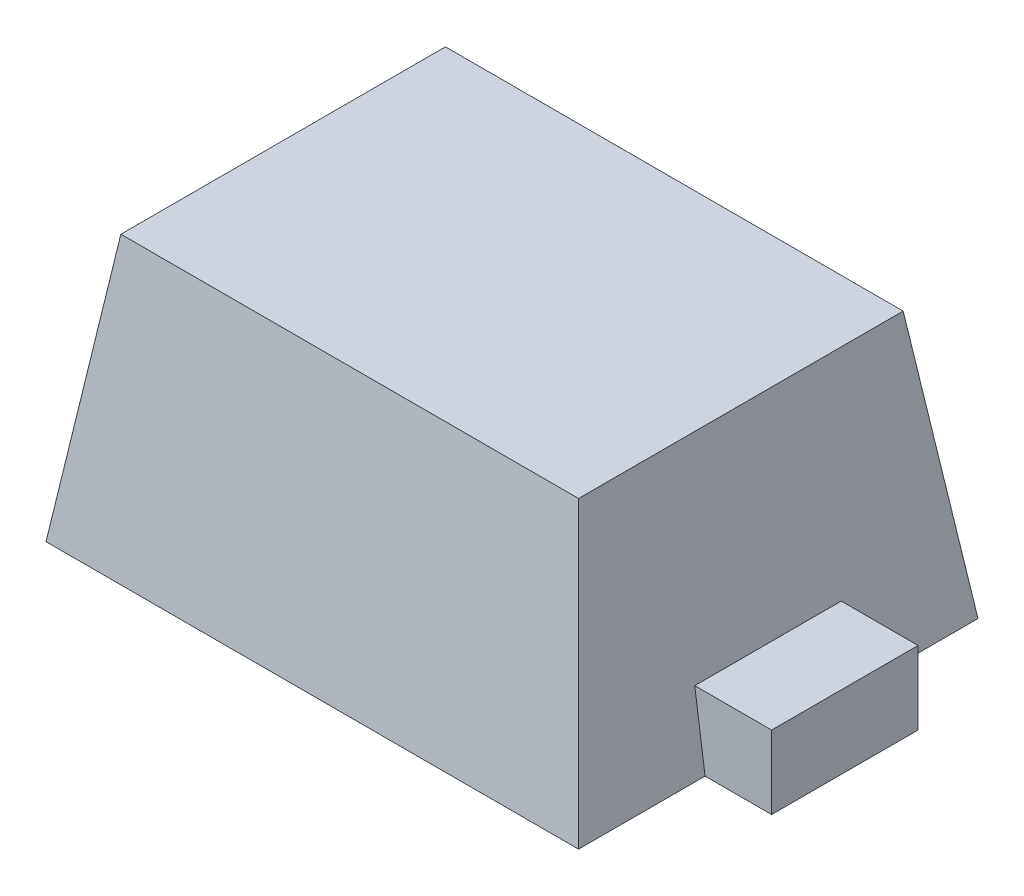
ISO-10303-21;
HEADER;
FILE_DESCRIPTION(('STEP AP214'),'2;1');
FILE_NAME('part.step','',(''),(''),'','','');
FILE_SCHEMA(('AUTOMOTIVE_DESIGN { 1 0 10303 214 1 1 1 1 }'));
ENDSEC;
DATA;
#1=APPLICATION_CONTEXT('core data for automotive mechanical design processes');
#2=APPLICATION_PROTOCOL_DEFINITION('international standard','automotive_design',2000,#1);
#3=PRODUCT_CONTEXT('',#1,'mechanical');
#4=PRODUCT('Part','Part','',(#3));
#5=PRODUCT_RELATED_PRODUCT_CATEGORY('part','',(#4));
#6=PRODUCT_DEFINITION_FORMATION('','',#4);
#7=PRODUCT_DEFINITION_CONTEXT('part definition',#1,'design');
#8=PRODUCT_DEFINITION('design','',#6,#7);
#9=PRODUCT_DEFINITION_SHAPE('','',#8);
#10=(LENGTH_UNIT() NAMED_UNIT(*) SI_UNIT(.MILLI.,.METRE.));
#11=(NAMED_UNIT(*) PLANE_ANGLE_UNIT() SI_UNIT($,.RADIAN.));
#12=(NAMED_UNIT(*) SI_UNIT($,.STERADIAN.) SOLID_ANGLE_UNIT());
#13=UNCERTAINTY_MEASURE_WITH_UNIT(LENGTH_MEASURE(1.E-05),#10,'distance_accuracy_value','');
#14=(GEOMETRIC_REPRESENTATION_CONTEXT(3) GLOBAL_UNCERTAINTY_ASSIGNED_CONTEXT((#13)) GLOBAL_UNIT_ASSIGNED_CONTEXT((#10,
#11,#12)) REPRESENTATION_CONTEXT('',''));
#15=CARTESIAN_POINT('',(0.,0.,0.));
#16=DIRECTION('',(0.,0.,1.));
#17=DIRECTION('',(1.,0.,0.));
#18=AXIS2_PLACEMENT_3D('',#15,#16,#17);
#19=CARTESIAN_POINT('',(-0.4,0.,0.3));
#20=DIRECTION('',(0.,1.,0.));
#21=DIRECTION('',(1.,0.,0.));
#22=AXIS2_PLACEMENT_3D('',#19,#20,#21);
#23=PLANE('',#22);
#24=DIRECTION('',(0.,0.,1.));
#25=VECTOR('',#24,1.);
#26=CARTESIAN_POINT('',(-0.4,0.,-0.3));
#27=LINE('',#26,#25);
#28=CARTESIAN_POINT('',(-0.4,0.,-0.3));
#29=VERTEX_POINT('',#28);
#30=CARTESIAN_POINT('',(-0.4,0.,0.3));
#31=VERTEX_POINT('',#30);
#32=EDGE_CURVE('P0_E81',#29,#31,#27,.T.);
#33=ORIENTED_EDGE('',*,*,#32,.F.);
#34=DIRECTION('',(-1.,0.,0.));
#35=VECTOR('',#34,1.);
#36=CARTESIAN_POINT('',(-0.4,0.,-0.3));
#37=LINE('',#36,#35);
#38=CARTESIAN_POINT('',(0.4,0.,-0.3));
#39=VERTEX_POINT('',#38);
#40=EDGE_CURVE('P0_E98',#39,#29,#37,.T.);
#41=ORIENTED_EDGE('',*,*,#40,.F.);
#42=DIRECTION('',(0.,0.,-1.));
#43=VECTOR('',#42,1.);
#44=CARTESIAN_POINT('',(0.4,0.,-0.3));
#45=LINE('',#44,#43);
#46=CARTESIAN_POINT('',(0.4,0.,0.3));
#47=VERTEX_POINT('',#46);
#48=EDGE_CURVE('P0_E112',#47,#39,#45,.T.);
#49=ORIENTED_EDGE('',*,*,#48,.F.);
#50=DIRECTION('',(1.,0.,0.));
#51=VECTOR('',#50,1.);
#52=CARTESIAN_POINT('',(-0.4,0.,0.3));
#53=LINE('',#52,#51);
#54=EDGE_CURVE('P0_E11',#31,#47,#53,.T.);
#55=ORIENTED_EDGE('',*,*,#54,.F.);
#56=EDGE_LOOP('',(#33,#41,#49,#55));
#57=FACE_BOUND('',#56,.T.);
#58=ADVANCED_FACE('P0_F17',(#57),#23,.F.);
#59=CARTESIAN_POINT('',(-0.4,0.,0.3));
#60=DIRECTION('',(0.,0.139173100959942,0.990268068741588));
#61=DIRECTION('',(1.,0.,0.));
#62=AXIS2_PLACEMENT_3D('',#59,#60,#61);
#63=PLANE('',#62);
#64=ORIENTED_EDGE('',*,*,#54,.T.);
#65=DIRECTION('',(0.137844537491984,-0.980814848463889,0.137844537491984));
#66=VECTOR('',#65,1.);
#67=CARTESIAN_POINT('',(0.38859933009,0.08111998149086,0.28859933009));
#68=LINE('',#67,#66);
#69=CARTESIAN_POINT('',(0.343783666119,0.4,0.243783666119));
#70=VERTEX_POINT('',#69);
#71=EDGE_CURVE('P0_E25',#70,#47,#68,.T.);
#72=ORIENTED_EDGE('',*,*,#71,.F.);
#73=DIRECTION('',(1.,0.,0.));
#74=VECTOR('',#73,1.);
#75=CARTESIAN_POINT('',(-0.4,0.4,0.243783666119));
#76=LINE('',#75,#74);
#77=CARTESIAN_POINT('',(-0.343783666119,0.4,0.243783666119));
#78=VERTEX_POINT('',#77);
#79=EDGE_CURVE('P0_E38',#78,#70,#76,.T.);
#80=ORIENTED_EDGE('',*,*,#79,.F.);
#81=DIRECTION('',(-0.137844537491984,-0.980814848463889,0.137844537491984));
#82=VECTOR('',#81,1.);
#83=CARTESIAN_POINT('',(-0.4,0.,0.3));
#84=LINE('',#83,#82);
#85=EDGE_CURVE('P0_E75',#78,#31,#84,.T.);
#86=ORIENTED_EDGE('',*,*,#85,.T.);
#87=EDGE_LOOP('',(#64,#72,#80,#86));
#88=FACE_BOUND('',#87,.T.);
#89=ADVANCED_FACE('P0_F89',(#88),#63,.T.);
#90=CARTESIAN_POINT('',(0.4,0.,-0.3));
#91=DIRECTION('',(0.990268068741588,0.139173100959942,0.));
#92=DIRECTION('',(0.,0.,-1.));
#93=AXIS2_PLACEMENT_3D('',#90,#91,#92);
#94=PLANE('',#93);
#95=ORIENTED_EDGE('',*,*,#48,.T.);
#96=DIRECTION('',(0.137844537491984,-0.980814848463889,-0.137844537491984));
#97=VECTOR('',#96,1.);
#98=CARTESIAN_POINT('',(0.384799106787,0.108159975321,-0.284799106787));
#99=LINE('',#98,#97);
#100=CARTESIAN_POINT('',(0.343783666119,0.4,-0.243783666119));
#101=VERTEX_POINT('',#100);
#102=EDGE_CURVE('P0_E100',#101,#39,#99,.T.);
#103=ORIENTED_EDGE('',*,*,#102,.F.);
#104=DIRECTION('',(0.,0.,-1.));
#105=VECTOR('',#104,1.);
#106=CARTESIAN_POINT('',(0.343783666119,0.4,-0.3));
#107=LINE('',#106,#105);
#108=EDGE_CURVE('P0_E108',#70,#101,#107,.T.);
#109=ORIENTED_EDGE('',*,*,#108,.F.);
#110=ORIENTED_EDGE('',*,*,#71,.T.);
#111=EDGE_LOOP('',(#95,#103,#109,#110));
#112=FACE_BOUND('',#111,.T.);
#113=ADVANCED_FACE('P0_F120',(#112),#94,.T.);
#114=CARTESIAN_POINT('',(-0.4,0.,-0.3));
#115=DIRECTION('',(0.,0.139173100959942,-0.990268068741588));
#116=DIRECTION('',(-1.,0.,0.));
#117=AXIS2_PLACEMENT_3D('',#114,#115,#116);
#118=PLANE('',#117);
#119=ORIENTED_EDGE('',*,*,#40,.T.);
#120=DIRECTION('',(-0.137844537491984,-0.980814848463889,-0.137844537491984));
#121=VECTOR('',#120,1.);
#122=CARTESIAN_POINT('',(-0.4,0.,-0.3));
#123=LINE('',#122,#121);
#124=CARTESIAN_POINT('',(-0.343783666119,0.4,-0.243783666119));
#125=VERTEX_POINT('',#124);
#126=EDGE_CURVE('P0_E83',#125,#29,#123,.T.);
#127=ORIENTED_EDGE('',*,*,#126,.F.);
#128=DIRECTION('',(-1.,0.,0.));
#129=VECTOR('',#128,1.);
#130=CARTESIAN_POINT('',(-0.4,0.4,-0.243783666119));
#131=LINE('',#130,#129);
#132=EDGE_CURVE('P0_E86',#101,#125,#131,.T.);
#133=ORIENTED_EDGE('',*,*,#132,.F.);
#134=ORIENTED_EDGE('',*,*,#102,.T.);
#135=EDGE_LOOP('',(#119,#127,#133,#134));
#136=FACE_BOUND('',#135,.T.);
#137=ADVANCED_FACE('P0_F124',(#136),#118,.T.);
#138=CARTESIAN_POINT('',(-0.4,0.,-0.3));
#139=DIRECTION('',(-0.990268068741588,0.139173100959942,0.));
#140=DIRECTION('',(0.,0.,1.));
#141=AXIS2_PLACEMENT_3D('',#138,#139,#140);
#142=PLANE('',#141);
#143=ORIENTED_EDGE('',*,*,#32,.T.);
#144=ORIENTED_EDGE('',*,*,#85,.F.);
#145=DIRECTION('',(0.,0.,1.));
#146=VECTOR('',#145,1.);
#147=CARTESIAN_POINT('',(-0.343783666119,0.4,-0.3));
#148=LINE('',#147,#146);
#149=EDGE_CURVE('P0_E78',#125,#78,#148,.T.);
#150=ORIENTED_EDGE('',*,*,#149,.F.);
#151=ORIENTED_EDGE('',*,*,#126,.T.);
#152=EDGE_LOOP('',(#143,#144,#150,#151));
#153=FACE_BOUND('',#152,.T.);
#154=ADVANCED_FACE('P0_F76',(#153),#142,.T.);
#155=CARTESIAN_POINT('',(-0.4,0.4,0.3));
#156=DIRECTION('',(0.,1.,0.));
#157=DIRECTION('',(1.,0.,0.));
#158=AXIS2_PLACEMENT_3D('',#155,#156,#157);
#159=PLANE('',#158);
#160=ORIENTED_EDGE('',*,*,#79,.T.);
#161=ORIENTED_EDGE('',*,*,#108,.T.);
#162=ORIENTED_EDGE('',*,*,#132,.T.);
#163=ORIENTED_EDGE('',*,*,#149,.T.);
#164=EDGE_LOOP('',(#160,#161,#162,#163));
#165=FACE_BOUND('',#164,.T.);
#166=ADVANCED_FACE('P0_F85',(#165),#159,.T.);
#167=CLOSED_SHELL('',(#58,#89,#113,#137,#154,#166));
#168=MANIFOLD_SOLID_BREP('P0_B1',#167);
#169=CARTESIAN_POINT('',(0.32,0.,0.11));
#170=DIRECTION('',(0.,1.,0.));
#171=DIRECTION('',(1.,0.,0.));
#172=AXIS2_PLACEMENT_3D('',#169,#170,#171);
#173=PLANE('',#172);
#174=DIRECTION('',(0.,0.,1.));
#175=VECTOR('',#174,1.);
#176=CARTESIAN_POINT('',(0.32,0.,-0.11));
#177=LINE('',#176,#175);
#178=CARTESIAN_POINT('',(0.32,0.,-0.11));
#179=VERTEX_POINT('',#178);
#180=CARTESIAN_POINT('',(0.32,0.,0.11));
#181=VERTEX_POINT('',#180);
#182=EDGE_CURVE('P1_E90',#179,#181,#177,.T.);
#183=ORIENTED_EDGE('',*,*,#182,.F.);
#184=DIRECTION('',(-1.,0.,0.));
#185=VECTOR('',#184,1.);
#186=CARTESIAN_POINT('',(0.32,0.,-0.11));
#187=LINE('',#186,#185);
#188=CARTESIAN_POINT('',(0.5,0.,-0.11));
#189=VERTEX_POINT('',#188);
#190=EDGE_CURVE('P1_E83',#189,#179,#187,.T.);
#191=ORIENTED_EDGE('',*,*,#190,.F.);
#192=DIRECTION('',(0.,0.,-1.));
#193=VECTOR('',#192,1.);
#194=CARTESIAN_POINT('',(0.5,0.,-0.11));
#195=LINE('',#194,#193);
#196=CARTESIAN_POINT('',(0.5,0.,0.11));
#197=VERTEX_POINT('',#196);
#198=EDGE_CURVE('P1_E70',#197,#189,#195,.T.);
#199=ORIENTED_EDGE('',*,*,#198,.F.);
#200=DIRECTION('',(1.,0.,0.));
#201=VECTOR('',#200,1.);
#202=CARTESIAN_POINT('',(0.32,0.,0.11));
#203=LINE('',#202,#201);
#204=EDGE_CURVE('P1_E26',#181,#197,#203,.T.);
#205=ORIENTED_EDGE('',*,*,#204,.F.);
#206=EDGE_LOOP('',(#183,#191,#199,#205));
#207=FACE_BOUND('',#206,.T.);
#208=ADVANCED_FACE('P1_F17',(#207),#173,.F.);
#209=CARTESIAN_POINT('',(0.32,0.11,0.11));
#210=DIRECTION('',(0.,1.,0.));
#211=DIRECTION('',(1.,0.,0.));
#212=AXIS2_PLACEMENT_3D('',#209,#210,#211);
#213=PLANE('',#212);
#214=DIRECTION('',(0.,0.,1.));
#215=VECTOR('',#214,1.);
#216=CARTESIAN_POINT('',(0.32,0.11,-0.11));
#217=LINE('',#216,#215);
#218=CARTESIAN_POINT('',(0.32,0.11,-0.11));
#219=VERTEX_POINT('',#218);
#220=CARTESIAN_POINT('',(0.32,0.11,0.11));
#221=VERTEX_POINT('',#220);
#222=EDGE_CURVE('P1_E100',#219,#221,#217,.T.);
#223=ORIENTED_EDGE('',*,*,#222,.T.);
#224=DIRECTION('',(1.,0.,0.));
#225=VECTOR('',#224,1.);
#226=CARTESIAN_POINT('',(0.32,0.11,0.11));
#227=LINE('',#226,#225);
#228=CARTESIAN_POINT('',(0.5,0.11,0.11));
#229=VERTEX_POINT('',#228);
#230=EDGE_CURVE('P1_E11',#221,#229,#227,.T.);
#231=ORIENTED_EDGE('',*,*,#230,.T.);
#232=DIRECTION('',(0.,0.,-1.));
#233=VECTOR('',#232,1.);
#234=CARTESIAN_POINT('',(0.5,0.11,-0.11));
#235=LINE('',#234,#233);
#236=CARTESIAN_POINT('',(0.5,0.11,-0.11));
#237=VERTEX_POINT('',#236);
#238=EDGE_CURVE('P1_E60',#229,#237,#235,.T.);
#239=ORIENTED_EDGE('',*,*,#238,.T.);
#240=DIRECTION('',(-1.,0.,0.));
#241=VECTOR('',#240,1.);
#242=CARTESIAN_POINT('',(0.32,0.11,-0.11));
#243=LINE('',#242,#241);
#244=EDGE_CURVE('P1_E85',#237,#219,#243,.T.);
#245=ORIENTED_EDGE('',*,*,#244,.T.);
#246=EDGE_LOOP('',(#223,#231,#239,#245));
#247=FACE_BOUND('',#246,.T.);
#248=ADVANCED_FACE('P1_F215',(#247),#213,.T.);
#249=CARTESIAN_POINT('',(0.32,0.11,0.11));
#250=DIRECTION('',(0.,0.,-1.));
#251=DIRECTION('',(0.,-1.,0.));
#252=AXIS2_PLACEMENT_3D('',#249,#250,#251);
#253=PLANE('',#252);
#254=ORIENTED_EDGE('',*,*,#204,.T.);
#255=DIRECTION('',(0.,-1.,0.));
#256=VECTOR('',#255,1.);
#257=CARTESIAN_POINT('',(0.5,0.11,0.11));
#258=LINE('',#257,#256);
#259=EDGE_CURVE('P1_E75',#229,#197,#258,.T.);
#260=ORIENTED_EDGE('',*,*,#259,.F.);
#261=ORIENTED_EDGE('',*,*,#230,.F.);
#262=DIRECTION('',(0.,-1.,0.));
#263=VECTOR('',#262,1.);
#264=CARTESIAN_POINT('',(0.32,0.11,0.11));
#265=LINE('',#264,#263);
#266=EDGE_CURVE('P1_E105',#221,#181,#265,.T.);
#267=ORIENTED_EDGE('',*,*,#266,.T.);
#268=EDGE_LOOP('',(#254,#260,#261,#267));
#269=FACE_BOUND('',#268,.T.);
#270=ADVANCED_FACE('P1_F119',(#269),#253,.F.);
#271=CARTESIAN_POINT('',(0.5,0.11,-0.11));
#272=DIRECTION('',(-1.,0.,0.));
#273=DIRECTION('',(0.,0.,1.));
#274=AXIS2_PLACEMENT_3D('',#271,#272,#273);
#275=PLANE('',#274);
#276=ORIENTED_EDGE('',*,*,#198,.T.);
#277=DIRECTION('',(0.,-1.,0.));
#278=VECTOR('',#277,1.);
#279=CARTESIAN_POINT('',(0.5,0.11,-0.11));
#280=LINE('',#279,#278);
#281=EDGE_CURVE('P1_E73',#237,#189,#280,.T.);
#282=ORIENTED_EDGE('',*,*,#281,.F.);
#283=ORIENTED_EDGE('',*,*,#238,.F.);
#284=ORIENTED_EDGE('',*,*,#259,.T.);
#285=EDGE_LOOP('',(#276,#282,#283,#284));
#286=FACE_BOUND('',#285,.T.);
#287=ADVANCED_FACE('P1_F72',(#286),#275,.F.);
#288=CARTESIAN_POINT('',(0.32,0.11,-0.11));
#289=DIRECTION('',(0.,0.,1.));
#290=DIRECTION('',(1.,0.,0.));
#291=AXIS2_PLACEMENT_3D('',#288,#289,#290);
#292=PLANE('',#291);
#293=ORIENTED_EDGE('',*,*,#190,.T.);
#294=DIRECTION('',(0.,-1.,0.));
#295=VECTOR('',#294,1.);
#296=CARTESIAN_POINT('',(0.32,0.11,-0.11));
#297=LINE('',#296,#295);
#298=EDGE_CURVE('P1_E92',#219,#179,#297,.T.);
#299=ORIENTED_EDGE('',*,*,#298,.F.);
#300=ORIENTED_EDGE('',*,*,#244,.F.);
#301=ORIENTED_EDGE('',*,*,#281,.T.);
#302=EDGE_LOOP('',(#293,#299,#300,#301));
#303=FACE_BOUND('',#302,.T.);
#304=ADVANCED_FACE('P1_F81',(#303),#292,.F.);
#305=CARTESIAN_POINT('',(0.32,0.11,-0.11));
#306=DIRECTION('',(1.,0.,0.));
#307=DIRECTION('',(0.,1.,0.));
#308=AXIS2_PLACEMENT_3D('',#305,#306,#307);
#309=PLANE('',#308);
#310=ORIENTED_EDGE('',*,*,#182,.T.);
#311=ORIENTED_EDGE('',*,*,#266,.F.);
#312=ORIENTED_EDGE('',*,*,#222,.F.);
#313=ORIENTED_EDGE('',*,*,#298,.T.);
#314=EDGE_LOOP('',(#310,#311,#312,#313));
#315=FACE_BOUND('',#314,.T.);
#316=ADVANCED_FACE('P1_F123',(#315),#309,.F.);
#317=CLOSED_SHELL('',(#208,#248,#270,#287,#304,#316));
#318=MANIFOLD_SOLID_BREP('P1_B1',#317);
#319=CARTESIAN_POINT('',(-0.5,0.,-0.11));
#320=DIRECTION('',(0.,1.,0.));
#321=DIRECTION('',(1.,0.,0.));
#322=AXIS2_PLACEMENT_3D('',#319,#320,#321);
#323=PLANE('',#322);
#324=DIRECTION('',(-1.,0.,0.));
#325=VECTOR('',#324,1.);
#326=CARTESIAN_POINT('',(-0.32,0.,-0.11));
#327=LINE('',#326,#325);
#328=CARTESIAN_POINT('',(-0.32,0.,-0.11));
#329=VERTEX_POINT('',#328);
#330=CARTESIAN_POINT('',(-0.5,0.,-0.11));
#331=VERTEX_POINT('',#330);
#332=EDGE_CURVE('P2_E91',#329,#331,#327,.T.);
#333=ORIENTED_EDGE('',*,*,#332,.F.);
#334=DIRECTION('',(0.,0.,-1.));
#335=VECTOR('',#334,1.);
#336=CARTESIAN_POINT('',(-0.32,0.,-0.11));
#337=LINE('',#336,#335);
#338=CARTESIAN_POINT('',(-0.32,0.,0.11));
#339=VERTEX_POINT('',#338);
#340=EDGE_CURVE('P2_E73',#339,#329,#337,.T.);
#341=ORIENTED_EDGE('',*,*,#340,.F.);
#342=DIRECTION('',(1.,0.,0.));
#343=VECTOR('',#342,1.);
#344=CARTESIAN_POINT('',(-0.32,0.,0.11));
#345=LINE('',#344,#343);
#346=CARTESIAN_POINT('',(-0.5,0.,0.11));
#347=VERTEX_POINT('',#346);
#348=EDGE_CURVE('P2_E105',#347,#339,#345,.T.);
#349=ORIENTED_EDGE('',*,*,#348,.F.);
#350=DIRECTION('',(0.,0.,1.));
#351=VECTOR('',#350,1.);
#352=CARTESIAN_POINT('',(-0.5,0.,-0.11));
#353=LINE('',#352,#351);
#354=EDGE_CURVE('P2_E25',#331,#347,#353,.T.);
#355=ORIENTED_EDGE('',*,*,#354,.F.);
#356=EDGE_LOOP('',(#333,#341,#349,#355));
#357=FACE_BOUND('',#356,.T.);
#358=ADVANCED_FACE('P2_F17',(#357),#323,.F.);
#359=CARTESIAN_POINT('',(-0.5,0.11,-0.11));
#360=DIRECTION('',(0.,1.,0.));
#361=DIRECTION('',(1.,0.,0.));
#362=AXIS2_PLACEMENT_3D('',#359,#360,#361);
#363=PLANE('',#362);
#364=DIRECTION('',(-1.,0.,0.));
#365=VECTOR('',#364,1.);
#366=CARTESIAN_POINT('',(-0.32,0.11,-0.11));
#367=LINE('',#366,#365);
#368=CARTESIAN_POINT('',(-0.32,0.11,-0.11));
#369=VERTEX_POINT('',#368);
#370=CARTESIAN_POINT('',(-0.5,0.11,-0.11));
#371=VERTEX_POINT('',#370);
#372=EDGE_CURVE('P2_E92',#369,#371,#367,.T.);
#373=ORIENTED_EDGE('',*,*,#372,.T.);
#374=DIRECTION('',(0.,0.,1.));
#375=VECTOR('',#374,1.);
#376=CARTESIAN_POINT('',(-0.5,0.11,-0.11));
#377=LINE('',#376,#375);
#378=CARTESIAN_POINT('',(-0.5,0.11,0.11));
#379=VERTEX_POINT('',#378);
#380=EDGE_CURVE('P2_E11',#371,#379,#377,.T.);
#381=ORIENTED_EDGE('',*,*,#380,.T.);
#382=DIRECTION('',(1.,0.,0.));
#383=VECTOR('',#382,1.);
#384=CARTESIAN_POINT('',(-0.32,0.11,0.11));
#385=LINE('',#384,#383);
#386=CARTESIAN_POINT('',(-0.32,0.11,0.11));
#387=VERTEX_POINT('',#386);
#388=EDGE_CURVE('P2_E110',#379,#387,#385,.T.);
#389=ORIENTED_EDGE('',*,*,#388,.T.);
#390=DIRECTION('',(0.,0.,-1.));
#391=VECTOR('',#390,1.);
#392=CARTESIAN_POINT('',(-0.32,0.11,-0.11));
#393=LINE('',#392,#391);
#394=EDGE_CURVE('P2_E85',#387,#369,#393,.T.);
#395=ORIENTED_EDGE('',*,*,#394,.T.);
#396=EDGE_LOOP('',(#373,#381,#389,#395));
#397=FACE_BOUND('',#396,.T.);
#398=ADVANCED_FACE('P2_F120',(#397),#363,.T.);
#399=CARTESIAN_POINT('',(-0.5,0.11,-0.11));
#400=DIRECTION('',(1.,0.,0.));
#401=DIRECTION('',(0.,1.,0.));
#402=AXIS2_PLACEMENT_3D('',#399,#400,#401);
#403=PLANE('',#402);
#404=ORIENTED_EDGE('',*,*,#354,.T.);
#405=DIRECTION('',(0.,-1.,0.));
#406=VECTOR('',#405,1.);
#407=CARTESIAN_POINT('',(-0.5,0.11,0.11));
#408=LINE('',#407,#406);
#409=EDGE_CURVE('P2_E108',#379,#347,#408,.T.);
#410=ORIENTED_EDGE('',*,*,#409,.F.);
#411=ORIENTED_EDGE('',*,*,#380,.F.);
#412=DIRECTION('',(0.,-1.,0.));
#413=VECTOR('',#412,1.);
#414=CARTESIAN_POINT('',(-0.5,0.11,-0.11));
#415=LINE('',#414,#413);
#416=EDGE_CURVE('P2_E96',#371,#331,#415,.T.);
#417=ORIENTED_EDGE('',*,*,#416,.T.);
#418=EDGE_LOOP('',(#404,#410,#411,#417));
#419=FACE_BOUND('',#418,.T.);
#420=ADVANCED_FACE('P2_F173',(#419),#403,.F.);
#421=CARTESIAN_POINT('',(-0.32,0.11,0.11));
#422=DIRECTION('',(0.,0.,-1.));
#423=DIRECTION('',(0.,-1.,0.));
#424=AXIS2_PLACEMENT_3D('',#421,#422,#423);
#425=PLANE('',#424);
#426=ORIENTED_EDGE('',*,*,#348,.T.);
#427=DIRECTION('',(0.,-1.,0.));
#428=VECTOR('',#427,1.);
#429=CARTESIAN_POINT('',(-0.32,0.11,0.11));
#430=LINE('',#429,#428);
#431=EDGE_CURVE('P2_E80',#387,#339,#430,.T.);
#432=ORIENTED_EDGE('',*,*,#431,.F.);
#433=ORIENTED_EDGE('',*,*,#388,.F.);
#434=ORIENTED_EDGE('',*,*,#409,.T.);
#435=EDGE_LOOP('',(#426,#432,#433,#434));
#436=FACE_BOUND('',#435,.T.);
#437=ADVANCED_FACE('P2_F123',(#436),#425,.F.);
#438=CARTESIAN_POINT('',(-0.32,0.11,-0.11));
#439=DIRECTION('',(-1.,0.,0.));
#440=DIRECTION('',(0.,0.,1.));
#441=AXIS2_PLACEMENT_3D('',#438,#439,#440);
#442=PLANE('',#441);
#443=ORIENTED_EDGE('',*,*,#340,.T.);
#444=DIRECTION('',(0.,-1.,0.));
#445=VECTOR('',#444,1.);
#446=CARTESIAN_POINT('',(-0.32,0.11,-0.11));
#447=LINE('',#446,#445);
#448=EDGE_CURVE('P2_E77',#369,#329,#447,.T.);
#449=ORIENTED_EDGE('',*,*,#448,.F.);
#450=ORIENTED_EDGE('',*,*,#394,.F.);
#451=ORIENTED_EDGE('',*,*,#431,.T.);
#452=EDGE_LOOP('',(#443,#449,#450,#451));
#453=FACE_BOUND('',#452,.T.);
#454=ADVANCED_FACE('P2_F75',(#453),#442,.F.);
#455=CARTESIAN_POINT('',(-0.32,0.11,-0.11));
#456=DIRECTION('',(0.,0.,1.));
#457=DIRECTION('',(1.,0.,0.));
#458=AXIS2_PLACEMENT_3D('',#455,#456,#457);
#459=PLANE('',#458);
#460=ORIENTED_EDGE('',*,*,#332,.T.);
#461=ORIENTED_EDGE('',*,*,#416,.F.);
#462=ORIENTED_EDGE('',*,*,#372,.F.);
#463=ORIENTED_EDGE('',*,*,#448,.T.);
#464=EDGE_LOOP('',(#460,#461,#462,#463));
#465=FACE_BOUND('',#464,.T.);
#466=ADVANCED_FACE('P2_F89',(#465),#459,.F.);
#467=CLOSED_SHELL('',(#358,#398,#420,#437,#454,#466));
#468=MANIFOLD_SOLID_BREP('P2_B1',#467);
#469=ADVANCED_BREP_SHAPE_REPRESENTATION('',(#18,#168,#318,#468),#14);
#470=SHAPE_DEFINITION_REPRESENTATION(#9,#469);
ENDSEC;
END-ISO-10303-21;
